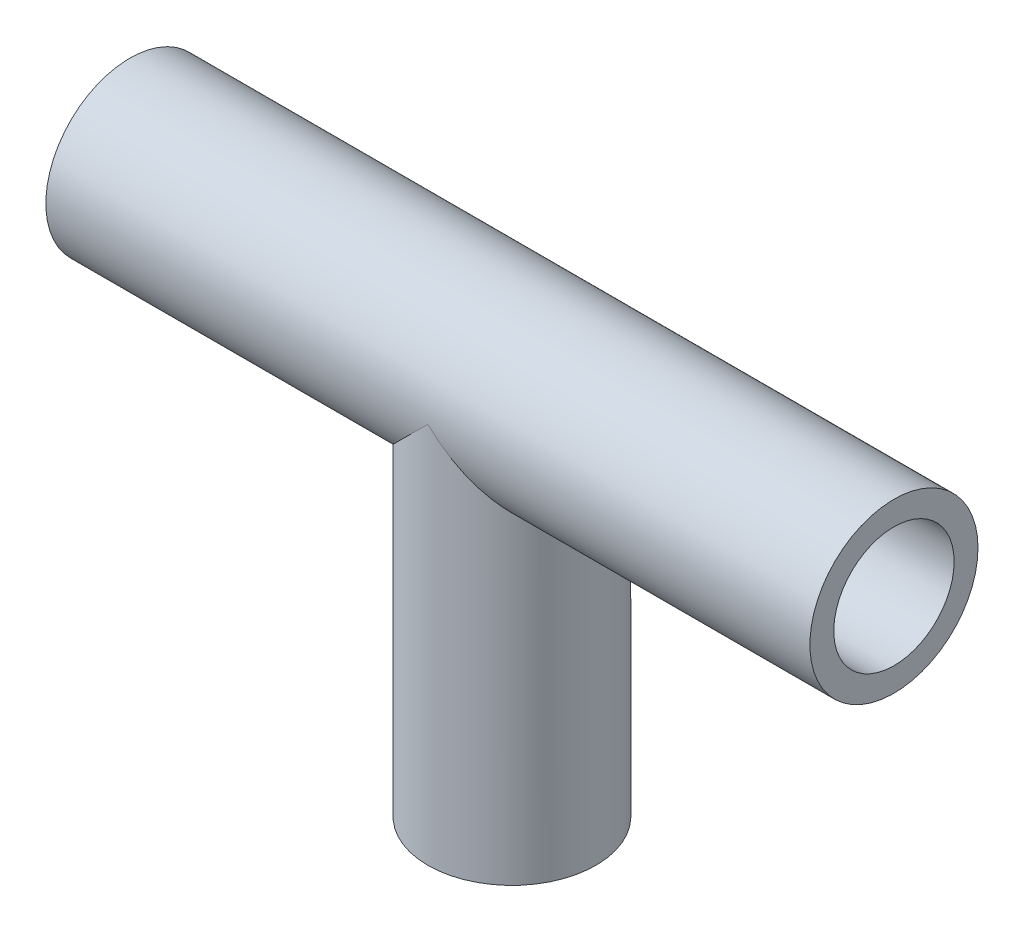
from build123d import *

# Parameters (mm, degrees)
SKETCH2_W                = 1.5875
SKETCH2_H                = 50.8
BOSS_EXTRUDE2_REACH      = 42.455
BOSS_EXTRUDE2_END_RADIUS = 5.588
SKETCH4_R                = 5.588
SKETCH4_R_2              = 4.0005


with BuildPart() as part:
    # Sketch2 → Revolve1 (revolve)
    with BuildSketch(Plane(origin=(0, 0, 0), x_dir=(0, 0, -1), z_dir=(0, 1, 0)), mode=Mode.PRIVATE) as revolve1_sk:
        with Locations((-4.79425, 0)):
            Rectangle(SKETCH2_W, SKETCH2_H)
    revolve(revolve1_sk.sketch.rotate(Axis((0, 0, 0), (-1, 0, 0)), 180), axis=Axis((0, 0, 0), (-1, 0, 0)))

    # Boss-Extrude2: up to this cylinder (the profile starts outside it)
    boss_extrude2_end = Plane(origin=(0, 0, 0), z_dir=(1, 0, 0)) * Cylinder(BOSS_EXTRUDE2_END_RADIUS, 97.086, mode=Mode.PRIVATE)
    # Sketch4 → Boss-Extrude2 (add, up to the surface)
    with BuildSketch(Plane(origin=(0, -25.4, 0), x_dir=(1, 0, 0), z_dir=(0, 1, 0)), mode=Mode.PRIVATE) as boss_extrude2_sk1:
        with Locations(Location((0, 0, 0), (0, 0, 270))):
            Circle(SKETCH4_R)
        with Locations(Location((0, 0, 0), (0, 0, 90))):
            Circle(SKETCH4_R_2, mode=Mode.SUBTRACT)
    boss_extrude2_tool1 = extrude(boss_extrude2_sk1.sketch, amount=BOSS_EXTRUDE2_REACH, mode=Mode.PRIVATE) - boss_extrude2_end
    add(boss_extrude2_tool1.solids().sort_by_distance((0, -25.4, -5.429947))[0])


solid = part.part
